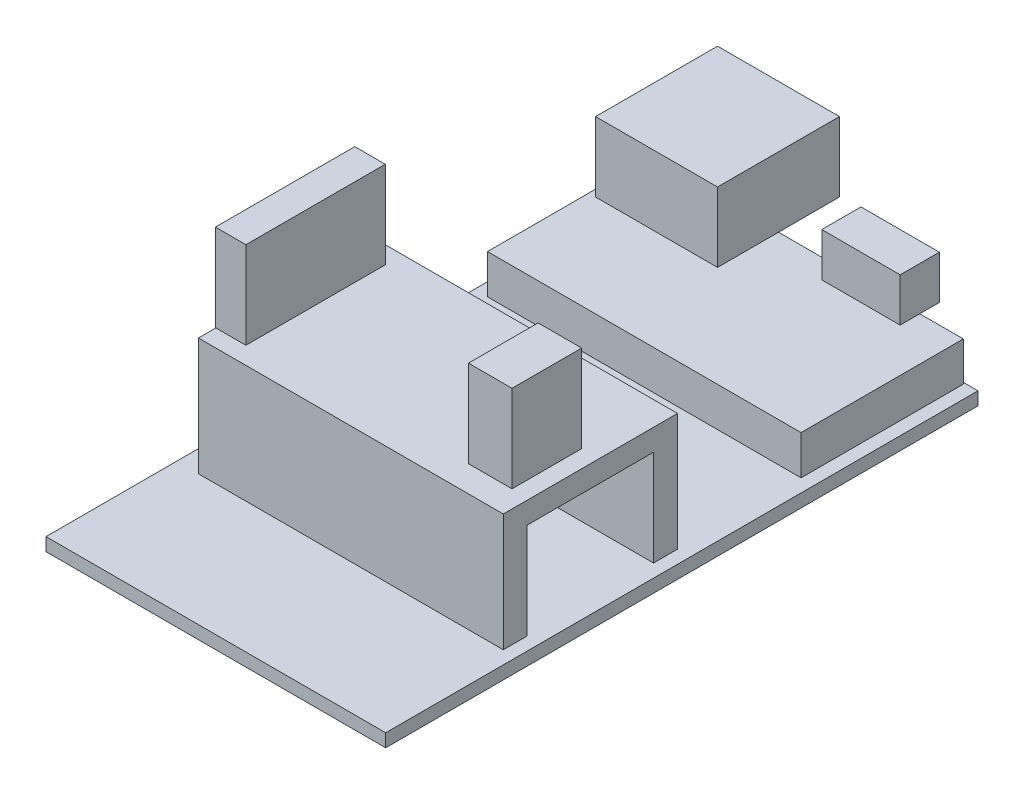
from build123d import *

# Parameters (mm, degrees)
SKETCH1_W           = 39
SKETCH1_H           = 68
BOSS_EXTRUDE1_DEPTH = 1.5
SKETCH2_W           = 35
SKETCH2_H           = 20
BOSS_EXTRUDE2_DEPTH = 15
SKETCH3_W           = 3.5
SKETCH3_H           = 16
SKETCH3_W_2         = 5
SKETCH3_H_2         = 8
BOSS_EXTRUDE3_DEPTH = 10
SKETCH4_W           = 14.502651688
SKETCH4_H           = 11.019658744
CUT_EXTRUDE1_DEPTH  = 40
SKETCH5_W           = 36
SKETCH5_H           = 18.624166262
BOSS_EXTRUDE4_DEPTH = 6
SKETCH6_W           = 14
SKETCH6_H           = 14
BOSS_EXTRUDE7_DEPTH = 8
SKETCH8_W           = 9
SKETCH8_H           = 4.5
BOSS_EXTRUDE8_DEPTH = 5


with BuildPart() as part:
    # Sketch1 → Boss-Extrude1 (new body)
    with BuildSketch(Plane(origin=(0, 0, 0), x_dir=(1, 0, 0), z_dir=(0, 1, 0))):
        Rectangle(SKETCH1_W, SKETCH1_H)
    extrude(amount=BOSS_EXTRUDE1_DEPTH)

    # Sketch2 → Boss-Extrude2 (add)
    with BuildSketch(Plane(origin=(0, 0, 0), x_dir=(1, 0, 0), z_dir=(0, 1, 0))):
        with Locations((0.5, -9)):
            Rectangle(SKETCH2_W, SKETCH2_H)
    extrude(amount=BOSS_EXTRUDE2_DEPTH)

    # Sketch3 → Boss-Extrude3 (add)
    with BuildSketch(Plane(origin=(0, 15, 0), x_dir=(1, 0, 0), z_dir=(0, 1, 0))):
        with Locations((-15.3, -9)):
            Rectangle(SKETCH3_W, SKETCH3_H)
        with Locations((13.5, -12)):
            Rectangle(SKETCH3_W_2, SKETCH3_H_2)
    extrude(amount=BOSS_EXTRUDE3_DEPTH)

    # Sketch4 → Cut-Extrude1 (cut)
    with BuildSketch(Plane.ZY.offset(17)):
        with Locations((9, 7.009829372)):
            Rectangle(SKETCH4_W, SKETCH4_H)
    extrude(amount=-CUT_EXTRUDE1_DEPTH, mode=Mode.SUBTRACT)

    # Sketch5 → Boss-Extrude4 (add)
    with BuildSketch(Plane(origin=(0, 0, 0), x_dir=(1, 0, 0), z_dir=(0, 1, 0))):
        with Locations((0, 24.5)):
            Rectangle(SKETCH5_W, SKETCH5_H)
    extrude(amount=BOSS_EXTRUDE4_DEPTH)

    # Sketch6 → Boss-Extrude7 (add)
    with BuildSketch(Plane(origin=(0, 6, 0), x_dir=(1, 0, 0), z_dir=(0, 1, 0))):
        with Locations((-10.217424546, 33.812083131)):
            Rectangle(SKETCH6_W, SKETCH6_H)
    extrude(amount=BOSS_EXTRUDE7_DEPTH)

    # Sketch8 → Boss-Extrude8 (add)
    with BuildSketch(Plane(origin=(0, 6, 0), x_dir=(1, 0, 0), z_dir=(0, 1, 0))):
        with Locations((8.5, 33.812083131)):
            Rectangle(SKETCH8_W, SKETCH8_H)
    extrude(amount=BOSS_EXTRUDE8_DEPTH)


solid = part.part
